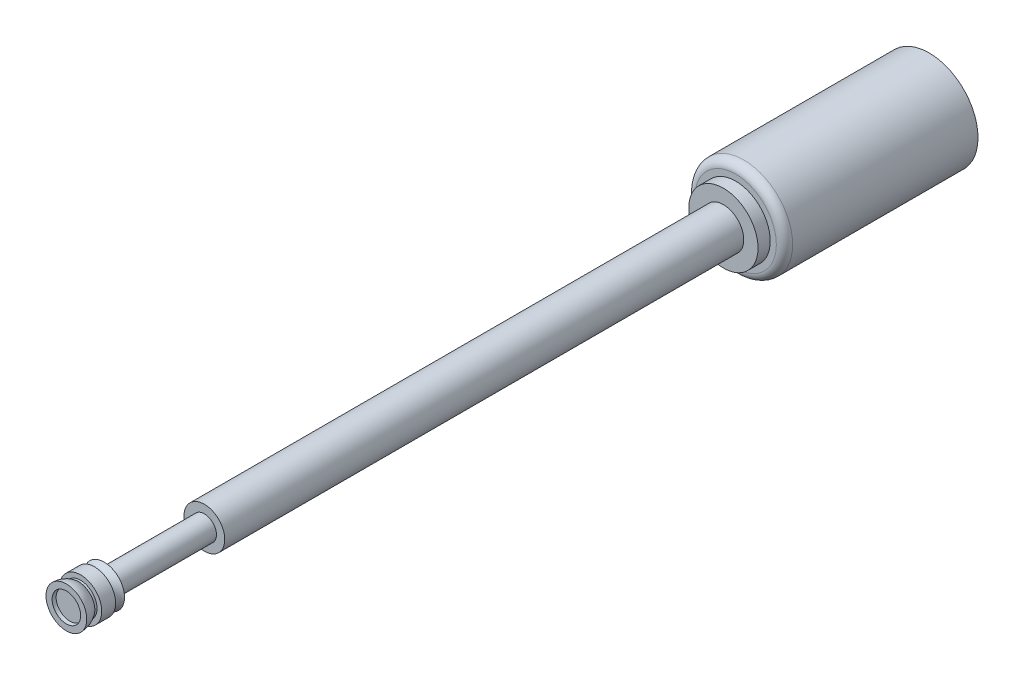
ISO-10303-21;
HEADER;
FILE_DESCRIPTION(('STEP AP214'),'2;1');
FILE_NAME('part.step','',(''),(''),'','','');
FILE_SCHEMA(('AUTOMOTIVE_DESIGN { 1 0 10303 214 1 1 1 1 }'));
ENDSEC;
DATA;
#1=APPLICATION_CONTEXT('core data for automotive mechanical design processes');
#2=APPLICATION_PROTOCOL_DEFINITION('international standard','automotive_design',2000,#1);
#3=PRODUCT_CONTEXT('',#1,'mechanical');
#4=PRODUCT('Part','Part','',(#3));
#5=PRODUCT_RELATED_PRODUCT_CATEGORY('part','',(#4));
#6=PRODUCT_DEFINITION_FORMATION('','',#4);
#7=PRODUCT_DEFINITION_CONTEXT('part definition',#1,'design');
#8=PRODUCT_DEFINITION('design','',#6,#7);
#9=PRODUCT_DEFINITION_SHAPE('','',#8);
#10=(LENGTH_UNIT() NAMED_UNIT(*) SI_UNIT(.MILLI.,.METRE.));
#11=(NAMED_UNIT(*) PLANE_ANGLE_UNIT() SI_UNIT($,.RADIAN.));
#12=(NAMED_UNIT(*) SI_UNIT($,.STERADIAN.) SOLID_ANGLE_UNIT());
#13=UNCERTAINTY_MEASURE_WITH_UNIT(LENGTH_MEASURE(1.E-05),#10,'distance_accuracy_value','');
#14=(GEOMETRIC_REPRESENTATION_CONTEXT(3) GLOBAL_UNCERTAINTY_ASSIGNED_CONTEXT((#13)) GLOBAL_UNIT_ASSIGNED_CONTEXT((#10,
#11,#12)) REPRESENTATION_CONTEXT('',''));
#15=CARTESIAN_POINT('',(0.,0.,0.));
#16=DIRECTION('',(0.,0.,1.));
#17=DIRECTION('',(1.,0.,0.));
#18=AXIS2_PLACEMENT_3D('',#15,#16,#17);
#19=CARTESIAN_POINT('',(0.,0.,16.4275));
#20=DIRECTION('',(0.,0.,-1.));
#21=DIRECTION('',(1.,0.,0.));
#22=AXIS2_PLACEMENT_3D('',#19,#20,#21);
#23=SPHERICAL_SURFACE('',#22,0.35);
#24=CARTESIAN_POINT('',(0.,0.,16.34));
#25=DIRECTION('',(0.,0.,1.));
#26=DIRECTION('',(1.,0.,0.));
#27=AXIS2_PLACEMENT_3D('',#24,#25,#26);
#28=CIRCLE('',#27,0.338886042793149);
#29=CARTESIAN_POINT('',(0.338886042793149,0.,16.34));
#30=VERTEX_POINT('',#29);
#31=EDGE_CURVE('E60',#30,#30,#28,.F.);
#32=ORIENTED_EDGE('',*,*,#31,.T.);
#33=EDGE_LOOP('',(#32));
#34=FACE_BOUND('',#33,.T.);
#35=CARTESIAN_POINT('',(0.,0.,16.4275));
#36=DIRECTION('',(0.,0.,-1.));
#37=DIRECTION('',(-1.,0.,0.));
#38=AXIS2_PLACEMENT_3D('',#35,#36,#37);
#39=CIRCLE('',#38,0.35);
#40=CARTESIAN_POINT('',(-0.35,0.,16.4275));
#41=VERTEX_POINT('',#40);
#42=EDGE_CURVE('E62',#41,#41,#39,.T.);
#43=ORIENTED_EDGE('',*,*,#42,.F.);
#44=EDGE_LOOP('',(#43));
#45=FACE_BOUND('',#44,.T.);
#46=ADVANCED_FACE('F36',(#34,#45),#23,.F.);
#47=CARTESIAN_POINT('',(0.,0.,15.7358129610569));
#48=DIRECTION('',(0.,0.,-1.));
#49=DIRECTION('',(-1.,0.,0.));
#50=AXIS2_PLACEMENT_3D('',#47,#48,#49);
#51=TOROIDAL_SURFACE('',#50,0.737649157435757,0.334790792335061);
#52=CARTESIAN_POINT('',(0.,0.,15.5));
#53=DIRECTION('',(0.,0.,-1.));
#54=DIRECTION('',(-1.,0.,0.));
#55=AXIS2_PLACEMENT_3D('',#52,#53,#54);
#56=CIRCLE('',#55,0.5);
#57=CARTESIAN_POINT('',(-0.5,0.,15.5));
#58=VERTEX_POINT('',#57);
#59=EDGE_CURVE('E74',#58,#58,#56,.F.);
#60=ORIENTED_EDGE('',*,*,#59,.T.);
#61=EDGE_LOOP('',(#60));
#62=FACE_BOUND('',#61,.T.);
#63=CARTESIAN_POINT('',(0.,0.,15.7358129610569));
#64=DIRECTION('',(0.,0.,-1.));
#65=DIRECTION('',(-1.,0.,0.));
#66=AXIS2_PLACEMENT_3D('',#63,#64,#65);
#67=CIRCLE('',#66,0.402858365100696);
#68=CARTESIAN_POINT('',(-0.402858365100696,0.,15.7358129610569));
#69=VERTEX_POINT('',#68);
#70=EDGE_CURVE('E88',#69,#69,#67,.T.);
#71=ORIENTED_EDGE('',*,*,#70,.T.);
#72=EDGE_LOOP('',(#71));
#73=FACE_BOUND('',#72,.T.);
#74=ADVANCED_FACE('F115',(#62,#73),#51,.F.);
#75=CARTESIAN_POINT('',(0.517709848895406,0.,15.7358129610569));
#76=DIRECTION('',(0.,0.,1.));
#77=DIRECTION('',(1.,0.,0.));
#78=AXIS2_PLACEMENT_3D('',#75,#76,#77);
#79=PLANE('',#78);
#80=ORIENTED_EDGE('',*,*,#70,.F.);
#81=EDGE_LOOP('',(#80));
#82=FACE_BOUND('',#81,.T.);
#83=CARTESIAN_POINT('',(0.,0.,15.7358129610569));
#84=DIRECTION('',(0.,0.,-1.));
#85=DIRECTION('',(-1.,0.,0.));
#86=AXIS2_PLACEMENT_3D('',#83,#84,#85);
#87=CIRCLE('',#86,0.517709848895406);
#88=CARTESIAN_POINT('',(-0.517709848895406,0.,15.7358129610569));
#89=VERTEX_POINT('',#88);
#90=EDGE_CURVE('E85',#89,#89,#87,.T.);
#91=ORIENTED_EDGE('',*,*,#90,.T.);
#92=EDGE_LOOP('',(#91));
#93=FACE_BOUND('',#92,.T.);
#94=ADVANCED_FACE('F121',(#82,#93),#79,.F.);
#95=CARTESIAN_POINT('',(0.,0.,15.5));
#96=DIRECTION('',(0.,0.,-1.));
#97=DIRECTION('',(-1.,0.,0.));
#98=AXIS2_PLACEMENT_3D('',#95,#96,#97);
#99=CYLINDRICAL_SURFACE('',#98,0.517709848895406);
#100=ORIENTED_EDGE('',*,*,#90,.F.);
#101=EDGE_LOOP('',(#100));
#102=FACE_BOUND('',#101,.T.);
#103=CARTESIAN_POINT('',(0.,0.,16.0775));
#104=DIRECTION('',(0.,0.,-1.));
#105=DIRECTION('',(-1.,0.,0.));
#106=AXIS2_PLACEMENT_3D('',#103,#104,#105);
#107=CIRCLE('',#106,0.517709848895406);
#108=CARTESIAN_POINT('',(-0.517709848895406,0.,16.0775));
#109=VERTEX_POINT('',#108);
#110=EDGE_CURVE('E82',#109,#109,#107,.T.);
#111=ORIENTED_EDGE('',*,*,#110,.T.);
#112=EDGE_LOOP('',(#111));
#113=FACE_BOUND('',#112,.T.);
#114=ADVANCED_FACE('F167',(#102,#113),#99,.T.);
#115=CARTESIAN_POINT('',(0.402858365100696,0.,16.0775));
#116=DIRECTION('',(0.,0.,-1.));
#117=DIRECTION('',(-1.,0.,0.));
#118=AXIS2_PLACEMENT_3D('',#115,#116,#117);
#119=PLANE('',#118);
#120=ORIENTED_EDGE('',*,*,#110,.F.);
#121=EDGE_LOOP('',(#120));
#122=FACE_BOUND('',#121,.T.);
#123=CARTESIAN_POINT('',(0.,0.,16.0775));
#124=DIRECTION('',(0.,0.,-1.));
#125=DIRECTION('',(-1.,0.,0.));
#126=AXIS2_PLACEMENT_3D('',#123,#124,#125);
#127=CIRCLE('',#126,0.402858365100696);
#128=CARTESIAN_POINT('',(-0.402858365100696,0.,16.0775));
#129=VERTEX_POINT('',#128);
#130=EDGE_CURVE('E79',#129,#129,#127,.T.);
#131=ORIENTED_EDGE('',*,*,#130,.T.);
#132=EDGE_LOOP('',(#131));
#133=FACE_BOUND('',#132,.T.);
#134=ADVANCED_FACE('F163',(#122,#133),#119,.F.);
#135=CARTESIAN_POINT('',(0.,0.,15.5));
#136=DIRECTION('',(0.,0.,-1.));
#137=DIRECTION('',(-1.,0.,0.));
#138=AXIS2_PLACEMENT_3D('',#135,#136,#137);
#139=CYLINDRICAL_SURFACE('',#138,0.402858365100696);
#140=ORIENTED_EDGE('',*,*,#130,.F.);
#141=EDGE_LOOP('',(#140));
#142=FACE_BOUND('',#141,.T.);
#143=CARTESIAN_POINT('',(0.,0.,16.1313494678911));
#144=DIRECTION('',(0.,0.,-1.));
#145=DIRECTION('',(-1.,0.,0.));
#146=AXIS2_PLACEMENT_3D('',#143,#144,#145);
#147=CIRCLE('',#146,0.402858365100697);
#148=CARTESIAN_POINT('',(-0.402858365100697,0.,16.1313494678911));
#149=VERTEX_POINT('',#148);
#150=EDGE_CURVE('E71',#149,#149,#147,.T.);
#151=ORIENTED_EDGE('',*,*,#150,.T.);
#152=EDGE_LOOP('',(#151));
#153=FACE_BOUND('',#152,.T.);
#154=ADVANCED_FACE('F156',(#142,#153),#139,.T.);
#155=CARTESIAN_POINT('',(0.,0.,16.4275));
#156=DIRECTION('',(0.,0.,-1.));
#157=DIRECTION('',(1.,0.,0.));
#158=AXIS2_PLACEMENT_3D('',#155,#156,#157);
#159=SPHERICAL_SURFACE('',#158,0.499999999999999);
#160=ORIENTED_EDGE('',*,*,#150,.F.);
#161=EDGE_LOOP('',(#160));
#162=FACE_BOUND('',#161,.T.);
#163=CARTESIAN_POINT('',(0.,0.,16.4275));
#164=DIRECTION('',(0.,0.,-1.));
#165=DIRECTION('',(-1.,0.,0.));
#166=AXIS2_PLACEMENT_3D('',#163,#164,#165);
#167=CIRCLE('',#166,0.5);
#168=CARTESIAN_POINT('',(-0.5,0.,16.4275));
#169=VERTEX_POINT('',#168);
#170=EDGE_CURVE('E66',#169,#169,#167,.T.);
#171=ORIENTED_EDGE('',*,*,#170,.T.);
#172=EDGE_LOOP('',(#171));
#173=FACE_BOUND('',#172,.T.);
#174=ADVANCED_FACE('F151',(#162,#173),#159,.T.);
#175=CARTESIAN_POINT('',(0.35,0.,16.4275));
#176=DIRECTION('',(0.,0.,-1.));
#177=DIRECTION('',(-1.,0.,0.));
#178=AXIS2_PLACEMENT_3D('',#175,#176,#177);
#179=PLANE('',#178);
#180=ORIENTED_EDGE('',*,*,#170,.F.);
#181=EDGE_LOOP('',(#180));
#182=FACE_BOUND('',#181,.T.);
#183=ORIENTED_EDGE('',*,*,#42,.T.);
#184=EDGE_LOOP('',(#183));
#185=FACE_BOUND('',#184,.T.);
#186=ADVANCED_FACE('F144',(#182,#185),#179,.F.);
#187=CARTESIAN_POINT('',(0.,0.,16.34));
#188=DIRECTION('',(0.,0.,1.));
#189=DIRECTION('',(1.,0.,0.));
#190=AXIS2_PLACEMENT_3D('',#187,#188,#189);
#191=PLANE('',#190);
#192=ORIENTED_EDGE('',*,*,#31,.F.);
#193=EDGE_LOOP('',(#192));
#194=FACE_BOUND('',#193,.T.);
#195=ADVANCED_FACE('F141',(#194),#191,.T.);
#196=CARTESIAN_POINT('',(-0.2962,0.,13.04));
#197=DIRECTION('',(0.,0.,-1.));
#198=DIRECTION('',(-1.,0.,0.));
#199=AXIS2_PLACEMENT_3D('',#196,#197,#198);
#200=PLANE('',#199);
#201=CARTESIAN_POINT('',(0.,0.,13.04));
#202=DIRECTION('',(0.,0.,-1.));
#203=DIRECTION('',(-1.,0.,0.));
#204=AXIS2_PLACEMENT_3D('',#201,#202,#203);
#205=CIRCLE('',#204,0.2962);
#206=CARTESIAN_POINT('',(-0.2962,0.,13.04));
#207=VERTEX_POINT('',#206);
#208=EDGE_CURVE('E316',#207,#207,#205,.T.);
#209=ORIENTED_EDGE('',*,*,#208,.T.);
#210=EDGE_LOOP('',(#209));
#211=FACE_BOUND('',#210,.T.);
#212=CARTESIAN_POINT('',(0.,0.,13.04));
#213=DIRECTION('',(0.,0.,-1.));
#214=DIRECTION('',(-1.,0.,0.));
#215=AXIS2_PLACEMENT_3D('',#212,#213,#214);
#216=CIRCLE('',#215,0.5);
#217=CARTESIAN_POINT('',(-0.5,0.,13.04));
#218=VERTEX_POINT('',#217);
#219=EDGE_CURVE('E40',#218,#218,#216,.T.);
#220=ORIENTED_EDGE('',*,*,#219,.F.);
#221=EDGE_LOOP('',(#220));
#222=FACE_BOUND('',#221,.T.);
#223=ADVANCED_FACE('F143',(#211,#222),#200,.F.);
#224=CARTESIAN_POINT('',(-0.2962,0.,15.5));
#225=DIRECTION('',(0.,0.,1.));
#226=DIRECTION('',(1.,0.,0.));
#227=AXIS2_PLACEMENT_3D('',#224,#225,#226);
#228=PLANE('',#227);
#229=CARTESIAN_POINT('',(0.,0.,15.5));
#230=DIRECTION('',(0.,0.,-1.));
#231=DIRECTION('',(-1.,0.,0.));
#232=AXIS2_PLACEMENT_3D('',#229,#230,#231);
#233=CIRCLE('',#232,0.2962);
#234=CARTESIAN_POINT('',(-0.2962,0.,15.5));
#235=VERTEX_POINT('',#234);
#236=EDGE_CURVE('E319',#235,#235,#233,.T.);
#237=ORIENTED_EDGE('',*,*,#236,.F.);
#238=EDGE_LOOP('',(#237));
#239=FACE_BOUND('',#238,.T.);
#240=ORIENTED_EDGE('',*,*,#59,.F.);
#241=EDGE_LOOP('',(#240));
#242=FACE_BOUND('',#241,.T.);
#243=ADVANCED_FACE('F109',(#239,#242),#228,.F.);
#244=CARTESIAN_POINT('',(0.,0.,15.5));
#245=DIRECTION('',(0.,0.,-1.));
#246=DIRECTION('',(-1.,0.,0.));
#247=AXIS2_PLACEMENT_3D('',#244,#245,#246);
#248=CYLINDRICAL_SURFACE('',#247,0.2962);
#249=ORIENTED_EDGE('',*,*,#208,.F.);
#250=EDGE_LOOP('',(#249));
#251=FACE_BOUND('',#250,.T.);
#252=ORIENTED_EDGE('',*,*,#236,.T.);
#253=EDGE_LOOP('',(#252));
#254=FACE_BOUND('',#253,.T.);
#255=ADVANCED_FACE('F102',(#251,#254),#248,.T.);
#256=CARTESIAN_POINT('',(0.,0.,-4.75));
#257=DIRECTION('',(0.,0.,1.));
#258=DIRECTION('',(1.,0.,0.));
#259=AXIS2_PLACEMENT_3D('',#256,#257,#258);
#260=PLANE('',#259);
#261=CARTESIAN_POINT('',(0.,0.,-4.75));
#262=DIRECTION('',(0.,0.,1.));
#263=DIRECTION('',(1.,0.,0.));
#264=AXIS2_PLACEMENT_3D('',#261,#262,#263);
#265=CIRCLE('',#264,1.2);
#266=CARTESIAN_POINT('',(1.2,0.,-4.75));
#267=VERTEX_POINT('',#266);
#268=EDGE_CURVE('E50',#267,#267,#265,.T.);
#269=ORIENTED_EDGE('',*,*,#268,.F.);
#270=EDGE_LOOP('',(#269));
#271=FACE_BOUND('',#270,.T.);
#272=ADVANCED_FACE('F100',(#271),#260,.F.);
#273=CARTESIAN_POINT('',(0.,0.,-4.75));
#274=DIRECTION('',(0.,0.,1.));
#275=DIRECTION('',(1.,0.,0.));
#276=AXIS2_PLACEMENT_3D('',#273,#274,#275);
#277=CYLINDRICAL_SURFACE('',#276,1.2);
#278=CARTESIAN_POINT('',(0.,0.,-0.2));
#279=DIRECTION('',(0.,0.,1.));
#280=DIRECTION('',(1.,0.,0.));
#281=AXIS2_PLACEMENT_3D('',#278,#279,#280);
#282=CIRCLE('',#281,1.2);
#283=CARTESIAN_POINT('',(1.2,0.,-0.2));
#284=VERTEX_POINT('',#283);
#285=EDGE_CURVE('E10',#284,#284,#282,.F.);
#286=ORIENTED_EDGE('',*,*,#285,.T.);
#287=EDGE_LOOP('',(#286));
#288=FACE_BOUND('',#287,.T.);
#289=ORIENTED_EDGE('',*,*,#268,.T.);
#290=EDGE_LOOP('',(#289));
#291=FACE_BOUND('',#290,.T.);
#292=ADVANCED_FACE('F98',(#288,#291),#277,.T.);
#293=CARTESIAN_POINT('',(0.,0.,-0.2));
#294=DIRECTION('',(0.,0.,1.));
#295=DIRECTION('',(1.,0.,0.));
#296=AXIS2_PLACEMENT_3D('',#293,#294,#295);
#297=TOROIDAL_SURFACE('',#296,1.,0.2);
#298=ORIENTED_EDGE('',*,*,#285,.F.);
#299=EDGE_LOOP('',(#298));
#300=FACE_BOUND('',#299,.T.);
#301=CARTESIAN_POINT('',(0.,0.,0.));
#302=DIRECTION('',(0.,0.,1.));
#303=DIRECTION('',(1.,0.,0.));
#304=AXIS2_PLACEMENT_3D('',#301,#302,#303);
#305=CIRCLE('',#304,1.);
#306=CARTESIAN_POINT('',(1.,0.,0.));
#307=VERTEX_POINT('',#306);
#308=EDGE_CURVE('E45',#307,#307,#305,.T.);
#309=ORIENTED_EDGE('',*,*,#308,.F.);
#310=EDGE_LOOP('',(#309));
#311=FACE_BOUND('',#310,.T.);
#312=ADVANCED_FACE('F38',(#300,#311),#297,.T.);
#313=CARTESIAN_POINT('',(0.,0.,0.));
#314=DIRECTION('',(0.,0.,1.));
#315=DIRECTION('',(1.,0.,0.));
#316=AXIS2_PLACEMENT_3D('',#313,#314,#315);
#317=PLANE('',#316);
#318=CARTESIAN_POINT('',(0.,0.,0.));
#319=DIRECTION('',(0.,0.,1.));
#320=DIRECTION('',(1.,0.,0.));
#321=AXIS2_PLACEMENT_3D('',#318,#319,#320);
#322=CIRCLE('',#321,0.85);
#323=CARTESIAN_POINT('',(0.85,0.,0.));
#324=VERTEX_POINT('',#323);
#325=EDGE_CURVE('E91',#324,#324,#322,.T.);
#326=ORIENTED_EDGE('',*,*,#325,.F.);
#327=EDGE_LOOP('',(#326));
#328=FACE_BOUND('',#327,.T.);
#329=ORIENTED_EDGE('',*,*,#308,.T.);
#330=EDGE_LOOP('',(#329));
#331=FACE_BOUND('',#330,.T.);
#332=ADVANCED_FACE('F181',(#328,#331),#317,.T.);
#333=CARTESIAN_POINT('',(0.,0.,0.3));
#334=DIRECTION('',(0.,0.,-1.));
#335=DIRECTION('',(-1.,0.,0.));
#336=AXIS2_PLACEMENT_3D('',#333,#334,#335);
#337=CYLINDRICAL_SURFACE('',#336,0.85);
#338=CARTESIAN_POINT('',(0.,0.,0.3));
#339=DIRECTION('',(0.,0.,1.));
#340=DIRECTION('',(1.,0.,0.));
#341=AXIS2_PLACEMENT_3D('',#338,#339,#340);
#342=CIRCLE('',#341,0.85);
#343=CARTESIAN_POINT('',(0.85,0.,0.3));
#344=VERTEX_POINT('',#343);
#345=EDGE_CURVE('E57',#344,#344,#342,.T.);
#346=ORIENTED_EDGE('',*,*,#345,.F.);
#347=EDGE_LOOP('',(#346));
#348=FACE_BOUND('',#347,.T.);
#349=ORIENTED_EDGE('',*,*,#325,.T.);
#350=EDGE_LOOP('',(#349));
#351=FACE_BOUND('',#350,.T.);
#352=ADVANCED_FACE('F178',(#348,#351),#337,.T.);
#353=CARTESIAN_POINT('',(0.,0.,0.3));
#354=DIRECTION('',(0.,0.,1.));
#355=DIRECTION('',(1.,0.,0.));
#356=AXIS2_PLACEMENT_3D('',#353,#354,#355);
#357=PLANE('',#356);
#358=CARTESIAN_POINT('',(0.,0.,0.3));
#359=DIRECTION('',(0.,0.,1.));
#360=DIRECTION('',(1.,0.,0.));
#361=AXIS2_PLACEMENT_3D('',#358,#359,#360);
#362=CIRCLE('',#361,0.5);
#363=CARTESIAN_POINT('',(0.5,0.,0.3));
#364=VERTEX_POINT('',#363);
#365=EDGE_CURVE('E54',#364,#364,#362,.T.);
#366=ORIENTED_EDGE('',*,*,#365,.F.);
#367=EDGE_LOOP('',(#366));
#368=FACE_BOUND('',#367,.T.);
#369=ORIENTED_EDGE('',*,*,#345,.T.);
#370=EDGE_LOOP('',(#369));
#371=FACE_BOUND('',#370,.T.);
#372=ADVANCED_FACE('F175',(#368,#371),#357,.T.);
#373=CARTESIAN_POINT('',(0.,0.,15.5));
#374=DIRECTION('',(0.,0.,-1.));
#375=DIRECTION('',(-1.,0.,0.));
#376=AXIS2_PLACEMENT_3D('',#373,#374,#375);
#377=CYLINDRICAL_SURFACE('',#376,0.5);
#378=ORIENTED_EDGE('',*,*,#219,.T.);
#379=EDGE_LOOP('',(#378));
#380=FACE_BOUND('',#379,.T.);
#381=ORIENTED_EDGE('',*,*,#365,.T.);
#382=EDGE_LOOP('',(#381));
#383=FACE_BOUND('',#382,.T.);
#384=ADVANCED_FACE('F177',(#380,#383),#377,.T.);
#385=CLOSED_SHELL('',(#46,#74,#94,#114,#134,#154,#174,#186,#195,#223,#243,#255,#272,#292,#312,
#332,#352,#372,#384));
#386=CARTESIAN_POINT('',(0.,0.,16.2673199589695));
#387=DIRECTION('',(0.,0.,-1.));
#388=DIRECTION('',(-1.,0.,0.));
#389=AXIS2_PLACEMENT_3D('',#386,#387,#388);
#390=CIRCLE('',#389,0.311195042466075);
#391=CARTESIAN_POINT('',(-0.311195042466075,0.,16.2673199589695));
#392=VERTEX_POINT('',#391);
#393=EDGE_CURVE('E58',#392,#392,#390,.F.);
#394=ORIENTED_EDGE('',*,*,#393,.T.);
#395=EDGE_LOOP('',(#394));
#396=FACE_BOUND('',#395,.T.);
#397=ADVANCED_FACE('F117',(#396),#23,.F.);
#398=CARTESIAN_POINT('',(0.,0.,16.2673199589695));
#399=DIRECTION('',(0.,0.,-1.));
#400=DIRECTION('',(-1.,0.,0.));
#401=AXIS2_PLACEMENT_3D('',#398,#399,#400);
#402=PLANE('',#401);
#403=ORIENTED_EDGE('',*,*,#393,.F.);
#404=EDGE_LOOP('',(#403));
#405=FACE_BOUND('',#404,.T.);
#406=ADVANCED_FACE('F128',(#405),#402,.T.);
#407=CLOSED_SHELL('',(#397,#406));
#408=ORIENTED_CLOSED_SHELL('',*,#407,.T.);
#409=BREP_WITH_VOIDS('B2',#385,(#408));
#410=ADVANCED_BREP_SHAPE_REPRESENTATION('',(#18,#409),#14);
#411=SHAPE_DEFINITION_REPRESENTATION(#9,#410);
ENDSEC;
END-ISO-10303-21;
